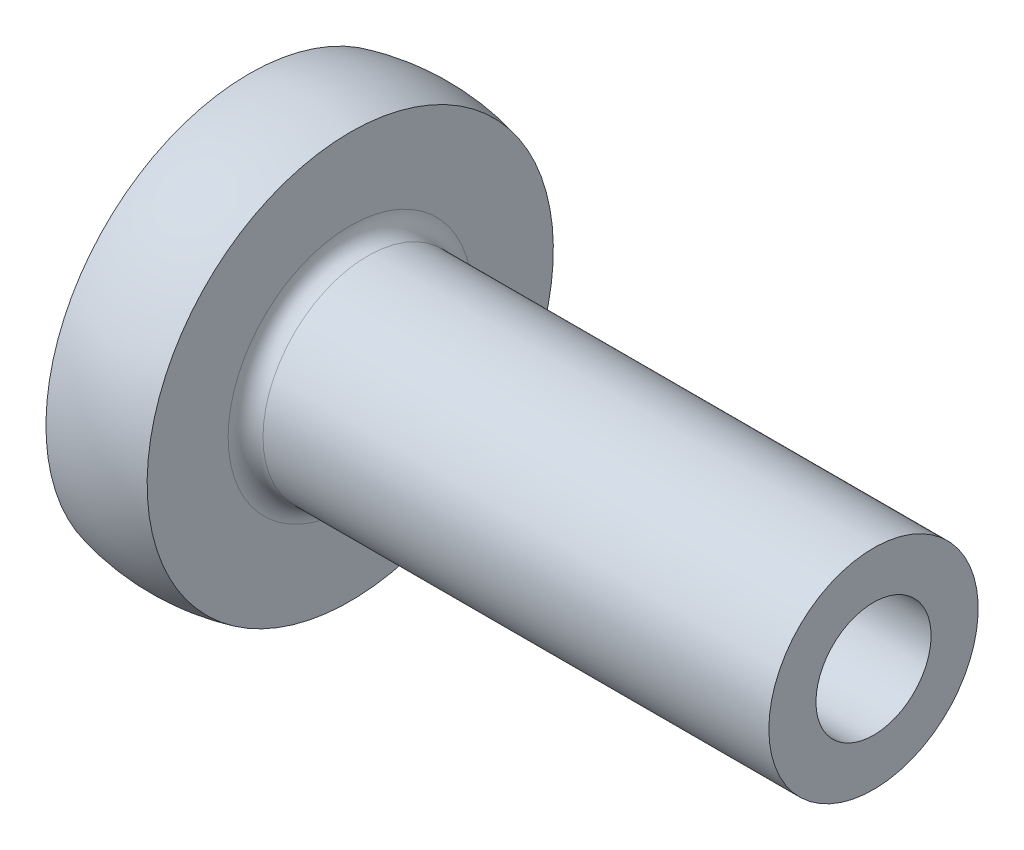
from build123d import *

# Parameters (mm, degrees)
FILLET1_R = 0.1


with BuildPart() as part:
    # Sketch1 → Base-Revolve (revolve)
    with BuildSketch(Plane.XY, mode=Mode.PRIVATE) as base_revolve_sk:
        with BuildLine():
            Line((0, 1.164431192), (0, 0))
            Line((0, 0), (1.949474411, 0))
            Line((1.949474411, 0), (2.14, 0.33))
            Line((2.14, 0.33), (3.58, 0.33))
            Line((3.58, 0.33), (3.58, 0.6))
            Line((3.58, 0.6), (0.58, 0.6))
            Line((0.58, 0.6), (0.58, 1.164431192))
            ThreePointArc((0.58, 1.164431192), (0.29, 1.2), (0, 1.164431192))
        make_face()
    revolve(base_revolve_sk.sketch.rotate(Axis((-2.318253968, 0, 0), (1, 0, 0)), 90), axis=Axis((-2.318253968, 0, 0), (1, 0, 0)))

    # Fillet1
    fillet1_edges = [part.edges().sort_by_distance(p)[0] for p in [
        (0.58, 0, -0.6),
    ]]
    fillet(fillet1_edges, radius=FILLET1_R)


solid = part.part
